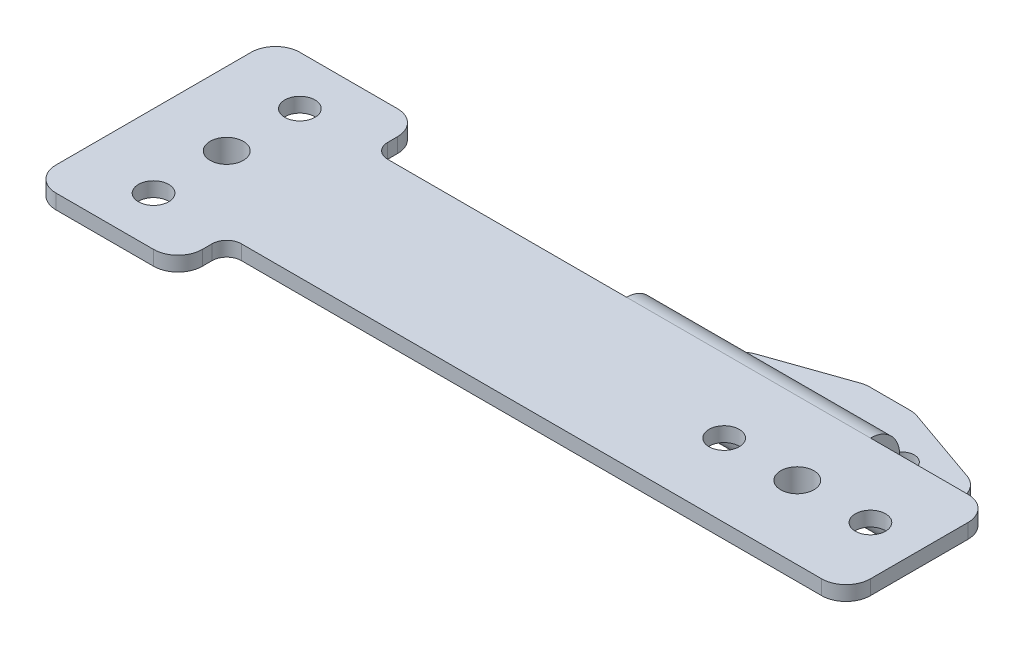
ISO-10303-21;
HEADER;
FILE_DESCRIPTION(('STEP AP214'),'2;1');
FILE_NAME('part.step','',(''),(''),'','','');
FILE_SCHEMA(('AUTOMOTIVE_DESIGN { 1 0 10303 214 1 1 1 1 }'));
ENDSEC;
DATA;
#1=APPLICATION_CONTEXT('core data for automotive mechanical design processes');
#2=APPLICATION_PROTOCOL_DEFINITION('international standard','automotive_design',2000,#1);
#3=PRODUCT_CONTEXT('',#1,'mechanical');
#4=PRODUCT('Part','Part','',(#3));
#5=PRODUCT_RELATED_PRODUCT_CATEGORY('part','',(#4));
#6=PRODUCT_DEFINITION_FORMATION('','',#4);
#7=PRODUCT_DEFINITION_CONTEXT('part definition',#1,'design');
#8=PRODUCT_DEFINITION('design','',#6,#7);
#9=PRODUCT_DEFINITION_SHAPE('','',#8);
#10=(LENGTH_UNIT() NAMED_UNIT(*) SI_UNIT(.MILLI.,.METRE.));
#11=(NAMED_UNIT(*) PLANE_ANGLE_UNIT() SI_UNIT($,.RADIAN.));
#12=(NAMED_UNIT(*) SI_UNIT($,.STERADIAN.) SOLID_ANGLE_UNIT());
#13=UNCERTAINTY_MEASURE_WITH_UNIT(LENGTH_MEASURE(1.E-05),#10,'distance_accuracy_value','');
#14=(GEOMETRIC_REPRESENTATION_CONTEXT(3) GLOBAL_UNCERTAINTY_ASSIGNED_CONTEXT((#13)) GLOBAL_UNIT_ASSIGNED_CONTEXT((#10,
#11,#12)) REPRESENTATION_CONTEXT('',''));
#15=CARTESIAN_POINT('',(0.,0.,0.));
#16=DIRECTION('',(0.,0.,1.));
#17=DIRECTION('',(1.,0.,0.));
#18=AXIS2_PLACEMENT_3D('',#15,#16,#17);
#19=CARTESIAN_POINT('',(-4.15027135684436,121.,270.));
#20=DIRECTION('',(0.,-1.,0.));
#21=DIRECTION('',(0.,0.,-1.));
#22=AXIS2_PLACEMENT_3D('',#19,#20,#21);
#23=CYLINDRICAL_SURFACE('',#22,5.);
#24=CARTESIAN_POINT('',(-4.15027135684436,121.,270.));
#25=DIRECTION('',(0.,-1.,0.));
#26=DIRECTION('',(0.,0.,-1.));
#27=AXIS2_PLACEMENT_3D('',#24,#25,#26);
#28=CIRCLE('',#27,5.);
#29=CARTESIAN_POINT('',(-5.80202348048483,121.,265.28070821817));
#30=VERTEX_POINT('',#29);
#31=CARTESIAN_POINT('',(-4.15027135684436,121.,265.));
#32=VERTEX_POINT('',#31);
#33=EDGE_CURVE('E20',#30,#32,#28,.T.);
#34=ORIENTED_EDGE('',*,*,#33,.T.);
#35=DIRECTION('',(0.,1.,0.));
#36=VECTOR('',#35,1.);
#37=CARTESIAN_POINT('',(-4.15027135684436,121.,265.));
#38=LINE('',#37,#36);
#39=CARTESIAN_POINT('',(-4.15027135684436,118.,265.));
#40=VERTEX_POINT('',#39);
#41=EDGE_CURVE('E279',#40,#32,#38,.T.);
#42=ORIENTED_EDGE('',*,*,#41,.F.);
#43=CARTESIAN_POINT('',(-4.15027135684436,118.,270.));
#44=DIRECTION('',(0.,-1.,0.));
#45=DIRECTION('',(0.,0.,-1.));
#46=AXIS2_PLACEMENT_3D('',#43,#44,#45);
#47=CIRCLE('',#46,5.);
#48=CARTESIAN_POINT('',(-5.80202348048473,118.,265.28070821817));
#49=VERTEX_POINT('',#48);
#50=EDGE_CURVE('E239',#49,#40,#47,.T.);
#51=ORIENTED_EDGE('',*,*,#50,.F.);
#52=DIRECTION('',(0.,1.,0.));
#53=VECTOR('',#52,1.);
#54=CARTESIAN_POINT('',(-5.80202348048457,121.,265.28070821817));
#55=LINE('',#54,#53);
#56=EDGE_CURVE('E238',#49,#30,#55,.T.);
#57=ORIENTED_EDGE('',*,*,#56,.T.);
#58=EDGE_LOOP('',(#34,#42,#51,#57));
#59=FACE_BOUND('',#58,.T.);
#60=ADVANCED_FACE('F17',(#59),#23,.T.);
#61=CARTESIAN_POINT('',(4.15027135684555,121.,270.));
#62=DIRECTION('',(0.,1.,0.));
#63=DIRECTION('',(0.,0.,1.));
#64=AXIS2_PLACEMENT_3D('',#61,#62,#63);
#65=CYLINDRICAL_SURFACE('',#64,5.);
#66=CARTESIAN_POINT('',(4.15027135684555,118.,270.));
#67=DIRECTION('',(0.,1.,0.));
#68=DIRECTION('',(0.,0.,1.));
#69=AXIS2_PLACEMENT_3D('',#66,#67,#68);
#70=CIRCLE('',#69,5.);
#71=CARTESIAN_POINT('',(4.15027135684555,118.,265.));
#72=VERTEX_POINT('',#71);
#73=CARTESIAN_POINT('',(5.80202348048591,118.,265.28070821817));
#74=VERTEX_POINT('',#73);
#75=EDGE_CURVE('E454',#72,#74,#70,.F.);
#76=ORIENTED_EDGE('',*,*,#75,.F.);
#77=DIRECTION('',(0.,1.,0.));
#78=VECTOR('',#77,1.);
#79=CARTESIAN_POINT('',(4.15027135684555,121.,265.));
#80=LINE('',#79,#78);
#81=CARTESIAN_POINT('',(4.15027135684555,121.,265.));
#82=VERTEX_POINT('',#81);
#83=EDGE_CURVE('E276',#82,#72,#80,.F.);
#84=ORIENTED_EDGE('',*,*,#83,.F.);
#85=CARTESIAN_POINT('',(4.15027135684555,121.,270.));
#86=DIRECTION('',(0.,1.,0.));
#87=DIRECTION('',(0.,0.,1.));
#88=AXIS2_PLACEMENT_3D('',#85,#86,#87);
#89=CIRCLE('',#88,5.);
#90=CARTESIAN_POINT('',(5.80202348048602,121.,265.280708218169));
#91=VERTEX_POINT('',#90);
#92=EDGE_CURVE('E236',#82,#91,#89,.F.);
#93=ORIENTED_EDGE('',*,*,#92,.T.);
#94=DIRECTION('',(0.,1.,0.));
#95=VECTOR('',#94,1.);
#96=CARTESIAN_POINT('',(5.80202348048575,121.,265.28070821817));
#97=LINE('',#96,#95);
#98=EDGE_CURVE('E284',#91,#74,#97,.F.);
#99=ORIENTED_EDGE('',*,*,#98,.T.);
#100=EDGE_LOOP('',(#76,#84,#93,#99));
#101=FACE_BOUND('',#100,.T.);
#102=ADVANCED_FACE('F460',(#101),#65,.T.);
#103=CARTESIAN_POINT('',(5.96744875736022E-13,118.,275.));
#104=DIRECTION('',(0.,-1.,0.));
#105=DIRECTION('',(0.,0.,-1.));
#106=AXIS2_PLACEMENT_3D('',#103,#104,#105);
#107=PLANE('',#106);
#108=DIRECTION('',(0.,0.,-1.));
#109=VECTOR('',#108,1.);
#110=CARTESIAN_POINT('',(25.0000000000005,118.,275.));
#111=LINE('',#110,#109);
#112=CARTESIAN_POINT('',(25.0000000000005,118.,285.));
#113=VERTEX_POINT('',#112);
#114=CARTESIAN_POINT('',(25.0000000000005,118.,275.547405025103));
#115=VERTEX_POINT('',#114);
#116=EDGE_CURVE('E272',#113,#115,#111,.T.);
#117=ORIENTED_EDGE('',*,*,#116,.F.);
#118=DIRECTION('',(-1.,0.,0.));
#119=VECTOR('',#118,1.);
#120=CARTESIAN_POINT('',(-24.9999999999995,118.,285.));
#121=LINE('',#120,#119);
#122=CARTESIAN_POINT('',(-24.9999999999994,118.,285.));
#123=VERTEX_POINT('',#122);
#124=EDGE_CURVE('E265',#123,#113,#121,.F.);
#125=ORIENTED_EDGE('',*,*,#124,.F.);
#126=DIRECTION('',(0.,0.,1.));
#127=VECTOR('',#126,1.);
#128=CARTESIAN_POINT('',(-24.9999999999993,118.,275.));
#129=LINE('',#128,#127);
#130=CARTESIAN_POINT('',(-24.9999999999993,118.,275.547405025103));
#131=VERTEX_POINT('',#130);
#132=EDGE_CURVE('E268',#131,#123,#129,.T.);
#133=ORIENTED_EDGE('',*,*,#132,.F.);
#134=CARTESIAN_POINT('',(-19.9999999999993,118.,275.547405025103));
#135=DIRECTION('',(0.,1.,0.));
#136=DIRECTION('',(0.,0.,1.));
#137=AXIS2_PLACEMENT_3D('',#134,#135,#136);
#138=CIRCLE('',#137,5.);
#139=CARTESIAN_POINT('',(-21.6517521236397,118.,270.828113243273));
#140=VERTEX_POINT('',#139);
#141=EDGE_CURVE('E291',#140,#131,#138,.T.);
#142=ORIENTED_EDGE('',*,*,#141,.F.);
#143=DIRECTION('',(0.943858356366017,0.,-0.330350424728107));
#144=VECTOR('',#143,1.);
#145=CARTESIAN_POINT('',(-24.9999999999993,118.,272.));
#146=LINE('',#145,#144);
#147=EDGE_CURVE('E242',#140,#49,#146,.T.);
#148=ORIENTED_EDGE('',*,*,#147,.T.);
#149=ORIENTED_EDGE('',*,*,#50,.T.);
#150=DIRECTION('',(1.,0.,0.));
#151=VECTOR('',#150,1.);
#152=CARTESIAN_POINT('',(5.96744875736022E-13,118.,265.));
#153=LINE('',#152,#151);
#154=EDGE_CURVE('E281',#72,#40,#153,.F.);
#155=ORIENTED_EDGE('',*,*,#154,.F.);
#156=ORIENTED_EDGE('',*,*,#75,.T.);
#157=DIRECTION('',(0.943858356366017,0.,0.330350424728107));
#158=VECTOR('',#157,1.);
#159=CARTESIAN_POINT('',(5.0000000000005,118.,265.));
#160=LINE('',#159,#158);
#161=CARTESIAN_POINT('',(21.6517521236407,118.,270.828113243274));
#162=VERTEX_POINT('',#161);
#163=EDGE_CURVE('E287',#74,#162,#160,.T.);
#164=ORIENTED_EDGE('',*,*,#163,.T.);
#165=CARTESIAN_POINT('',(20.0000000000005,118.,275.547405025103));
#166=DIRECTION('',(0.,-1.,0.));
#167=DIRECTION('',(0.,0.,-1.));
#168=AXIS2_PLACEMENT_3D('',#165,#166,#167);
#169=CIRCLE('',#168,5.);
#170=EDGE_CURVE('E285',#115,#162,#169,.F.);
#171=ORIENTED_EDGE('',*,*,#170,.F.);
#172=EDGE_LOOP('',(#117,#125,#133,#142,#148,#149,#155,#156,#164,#171));
#173=FACE_BOUND('',#172,.T.);
#174=CARTESIAN_POINT('',(-12.4999999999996,118.,275.));
#175=DIRECTION('',(0.,-1.,0.));
#176=DIRECTION('',(0.,0.,-1.));
#177=AXIS2_PLACEMENT_3D('',#174,#175,#176);
#178=CIRCLE('',#177,2.5);
#179=CARTESIAN_POINT('',(-12.4999999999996,118.,272.5));
#180=VERTEX_POINT('',#179);
#181=EDGE_CURVE('E243',#180,#180,#178,.F.);
#182=ORIENTED_EDGE('',*,*,#181,.T.);
#183=EDGE_LOOP('',(#182));
#184=FACE_BOUND('',#183,.T.);
#185=CARTESIAN_POINT('',(12.5000000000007,118.,275.));
#186=DIRECTION('',(0.,-1.,0.));
#187=DIRECTION('',(0.,0.,-1.));
#188=AXIS2_PLACEMENT_3D('',#185,#186,#187);
#189=CIRCLE('',#188,2.5);
#190=CARTESIAN_POINT('',(12.5000000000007,118.,272.5));
#191=VERTEX_POINT('',#190);
#192=EDGE_CURVE('E451',#191,#191,#189,.F.);
#193=ORIENTED_EDGE('',*,*,#192,.T.);
#194=EDGE_LOOP('',(#193));
#195=FACE_BOUND('',#194,.T.);
#196=ADVANCED_FACE('F491',(#173,#184,#195),#107,.T.);
#197=CARTESIAN_POINT('',(12.5000000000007,121.,275.));
#198=DIRECTION('',(0.,-1.,0.));
#199=DIRECTION('',(0.,0.,-1.));
#200=AXIS2_PLACEMENT_3D('',#197,#198,#199);
#201=CYLINDRICAL_SURFACE('',#200,2.5);
#202=CARTESIAN_POINT('',(12.5000000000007,121.,275.));
#203=DIRECTION('',(0.,-1.,0.));
#204=DIRECTION('',(0.,0.,-1.));
#205=AXIS2_PLACEMENT_3D('',#202,#203,#204);
#206=CIRCLE('',#205,2.5);
#207=CARTESIAN_POINT('',(12.5000000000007,121.,272.5));
#208=VERTEX_POINT('',#207);
#209=EDGE_CURVE('E255',#208,#208,#206,.T.);
#210=ORIENTED_EDGE('',*,*,#209,.F.);
#211=EDGE_LOOP('',(#210));
#212=FACE_BOUND('',#211,.T.);
#213=ORIENTED_EDGE('',*,*,#192,.F.);
#214=EDGE_LOOP('',(#213));
#215=FACE_BOUND('',#214,.T.);
#216=ADVANCED_FACE('F923',(#212,#215),#201,.F.);
#217=CARTESIAN_POINT('',(-12.4999999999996,121.,275.));
#218=DIRECTION('',(0.,-1.,0.));
#219=DIRECTION('',(0.,0.,-1.));
#220=AXIS2_PLACEMENT_3D('',#217,#218,#219);
#221=CYLINDRICAL_SURFACE('',#220,2.5);
#222=CARTESIAN_POINT('',(-12.4999999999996,121.,275.));
#223=DIRECTION('',(0.,-1.,0.));
#224=DIRECTION('',(0.,0.,-1.));
#225=AXIS2_PLACEMENT_3D('',#222,#223,#224);
#226=CIRCLE('',#225,2.5);
#227=CARTESIAN_POINT('',(-12.4999999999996,121.,272.5));
#228=VERTEX_POINT('',#227);
#229=EDGE_CURVE('E250',#228,#228,#226,.T.);
#230=ORIENTED_EDGE('',*,*,#229,.F.);
#231=EDGE_LOOP('',(#230));
#232=FACE_BOUND('',#231,.T.);
#233=ORIENTED_EDGE('',*,*,#181,.F.);
#234=EDGE_LOOP('',(#233));
#235=FACE_BOUND('',#234,.T.);
#236=ADVANCED_FACE('F915',(#232,#235),#221,.F.);
#237=CARTESIAN_POINT('',(-24.9999999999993,121.,272.));
#238=DIRECTION('',(0.330350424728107,0.,0.943858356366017));
#239=DIRECTION('',(0.943858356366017,0.,-0.330350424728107));
#240=AXIS2_PLACEMENT_3D('',#237,#238,#239);
#241=PLANE('',#240);
#242=DIRECTION('',(0.,1.,0.));
#243=VECTOR('',#242,1.);
#244=CARTESIAN_POINT('',(-21.6517521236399,121.,270.828113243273));
#245=LINE('',#244,#243);
#246=CARTESIAN_POINT('',(-21.6517521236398,121.,270.828113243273));
#247=VERTEX_POINT('',#246);
#248=EDGE_CURVE('E247',#247,#140,#245,.F.);
#249=ORIENTED_EDGE('',*,*,#248,.F.);
#250=DIRECTION('',(-0.943858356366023,0.,0.330350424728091));
#251=VECTOR('',#250,1.);
#252=CARTESIAN_POINT('',(-5.80202348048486,121.,265.280708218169));
#253=LINE('',#252,#251);
#254=EDGE_CURVE('E230',#30,#247,#253,.T.);
#255=ORIENTED_EDGE('',*,*,#254,.F.);
#256=ORIENTED_EDGE('',*,*,#56,.F.);
#257=ORIENTED_EDGE('',*,*,#147,.F.);
#258=EDGE_LOOP('',(#249,#255,#256,#257));
#259=FACE_BOUND('',#258,.T.);
#260=ADVANCED_FACE('F245',(#259),#241,.F.);
#261=CARTESIAN_POINT('',(-19.9999999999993,121.,275.547405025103));
#262=DIRECTION('',(0.,1.,0.));
#263=DIRECTION('',(0.,0.,1.));
#264=AXIS2_PLACEMENT_3D('',#261,#262,#263);
#265=CYLINDRICAL_SURFACE('',#264,5.);
#266=ORIENTED_EDGE('',*,*,#141,.T.);
#267=DIRECTION('',(0.,1.,0.));
#268=VECTOR('',#267,1.);
#269=CARTESIAN_POINT('',(-24.9999999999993,121.,275.547405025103));
#270=LINE('',#269,#268);
#271=CARTESIAN_POINT('',(-24.9999999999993,121.,275.547405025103));
#272=VERTEX_POINT('',#271);
#273=EDGE_CURVE('E271',#272,#131,#270,.F.);
#274=ORIENTED_EDGE('',*,*,#273,.F.);
#275=CARTESIAN_POINT('',(-19.9999999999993,121.,275.547405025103));
#276=DIRECTION('',(0.,1.,0.));
#277=DIRECTION('',(0.,0.,1.));
#278=AXIS2_PLACEMENT_3D('',#275,#276,#277);
#279=CIRCLE('',#278,5.);
#280=EDGE_CURVE('E249',#247,#272,#279,.T.);
#281=ORIENTED_EDGE('',*,*,#280,.F.);
#282=ORIENTED_EDGE('',*,*,#248,.T.);
#283=EDGE_LOOP('',(#266,#274,#281,#282));
#284=FACE_BOUND('',#283,.T.);
#285=ADVANCED_FACE('F899',(#284),#265,.T.);
#286=CARTESIAN_POINT('',(20.0000000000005,121.,275.547405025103));
#287=DIRECTION('',(0.,-1.,0.));
#288=DIRECTION('',(0.,0.,-1.));
#289=AXIS2_PLACEMENT_3D('',#286,#287,#288);
#290=CYLINDRICAL_SURFACE('',#289,5.);
#291=CARTESIAN_POINT('',(20.0000000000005,121.,275.547405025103));
#292=DIRECTION('',(0.,-1.,0.));
#293=DIRECTION('',(0.,0.,-1.));
#294=AXIS2_PLACEMENT_3D('',#291,#292,#293);
#295=CIRCLE('',#294,5.);
#296=CARTESIAN_POINT('',(25.0000000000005,121.,275.547405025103));
#297=VERTEX_POINT('',#296);
#298=CARTESIAN_POINT('',(21.6517521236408,121.,270.828113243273));
#299=VERTEX_POINT('',#298);
#300=EDGE_CURVE('E440',#297,#299,#295,.F.);
#301=ORIENTED_EDGE('',*,*,#300,.F.);
#302=DIRECTION('',(0.,1.,0.));
#303=VECTOR('',#302,1.);
#304=CARTESIAN_POINT('',(25.0000000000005,121.,275.547405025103));
#305=LINE('',#304,#303);
#306=EDGE_CURVE('E275',#115,#297,#305,.T.);
#307=ORIENTED_EDGE('',*,*,#306,.F.);
#308=ORIENTED_EDGE('',*,*,#170,.T.);
#309=DIRECTION('',(0.,1.,0.));
#310=VECTOR('',#309,1.);
#311=CARTESIAN_POINT('',(21.6517521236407,121.,270.828113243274));
#312=LINE('',#311,#310);
#313=EDGE_CURVE('E282',#162,#299,#312,.T.);
#314=ORIENTED_EDGE('',*,*,#313,.T.);
#315=EDGE_LOOP('',(#301,#307,#308,#314));
#316=FACE_BOUND('',#315,.T.);
#317=ADVANCED_FACE('F489',(#316),#290,.T.);
#318=CARTESIAN_POINT('',(5.0000000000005,121.,265.));
#319=DIRECTION('',(-0.330350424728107,0.,0.943858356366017));
#320=DIRECTION('',(0.943858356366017,0.,0.330350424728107));
#321=AXIS2_PLACEMENT_3D('',#318,#319,#320);
#322=PLANE('',#321);
#323=ORIENTED_EDGE('',*,*,#98,.F.);
#324=DIRECTION('',(-0.943858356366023,0.,-0.330350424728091));
#325=VECTOR('',#324,1.);
#326=CARTESIAN_POINT('',(21.6517521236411,121.,270.828113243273));
#327=LINE('',#326,#325);
#328=EDGE_CURVE('E442',#299,#91,#327,.T.);
#329=ORIENTED_EDGE('',*,*,#328,.F.);
#330=ORIENTED_EDGE('',*,*,#313,.F.);
#331=ORIENTED_EDGE('',*,*,#163,.F.);
#332=EDGE_LOOP('',(#323,#329,#330,#331));
#333=FACE_BOUND('',#332,.T.);
#334=ADVANCED_FACE('F465',(#333),#322,.F.);
#335=CARTESIAN_POINT('',(5.96744875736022E-13,121.,265.));
#336=DIRECTION('',(0.,0.,-1.));
#337=DIRECTION('',(0.,1.,0.));
#338=AXIS2_PLACEMENT_3D('',#335,#336,#337);
#339=PLANE('',#338);
#340=DIRECTION('',(1.,0.,0.));
#341=VECTOR('',#340,1.);
#342=CARTESIAN_POINT('',(5.96744875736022E-13,121.,265.));
#343=LINE('',#342,#341);
#344=EDGE_CURVE('E232',#82,#32,#343,.F.);
#345=ORIENTED_EDGE('',*,*,#344,.F.);
#346=ORIENTED_EDGE('',*,*,#83,.T.);
#347=ORIENTED_EDGE('',*,*,#154,.T.);
#348=ORIENTED_EDGE('',*,*,#41,.T.);
#349=EDGE_LOOP('',(#345,#346,#347,#348));
#350=FACE_BOUND('',#349,.T.);
#351=ADVANCED_FACE('F495',(#350),#339,.T.);
#352=CARTESIAN_POINT('',(-24.9999999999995,124.,285.));
#353=DIRECTION('',(-1.,0.,0.));
#354=DIRECTION('',(0.,0.,1.));
#355=AXIS2_PLACEMENT_3D('',#352,#353,#354);
#356=CYLINDRICAL_SURFACE('',#355,6.);
#357=DIRECTION('',(1.,0.,0.));
#358=VECTOR('',#357,1.);
#359=CARTESIAN_POINT('',(25.0000000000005,124.,291.));
#360=LINE('',#359,#358);
#361=CARTESIAN_POINT('',(-24.9999999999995,124.,291.));
#362=VERTEX_POINT('',#361);
#363=CARTESIAN_POINT('',(25.0000000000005,124.,291.));
#364=VERTEX_POINT('',#363);
#365=EDGE_CURVE('E433',#362,#364,#360,.T.);
#366=ORIENTED_EDGE('',*,*,#365,.F.);
#367=CARTESIAN_POINT('',(-24.9999999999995,124.,285.));
#368=DIRECTION('',(-1.,0.,0.));
#369=DIRECTION('',(0.,0.,1.));
#370=AXIS2_PLACEMENT_3D('',#367,#368,#369);
#371=CIRCLE('',#370,6.);
#372=EDGE_CURVE('E434',#123,#362,#371,.T.);
#373=ORIENTED_EDGE('',*,*,#372,.F.);
#374=ORIENTED_EDGE('',*,*,#124,.T.);
#375=CARTESIAN_POINT('',(25.0000000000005,124.,285.));
#376=DIRECTION('',(-1.,0.,0.));
#377=DIRECTION('',(0.,0.,1.));
#378=AXIS2_PLACEMENT_3D('',#375,#376,#377);
#379=CIRCLE('',#378,6.);
#380=EDGE_CURVE('E437',#364,#113,#379,.F.);
#381=ORIENTED_EDGE('',*,*,#380,.F.);
#382=EDGE_LOOP('',(#366,#373,#374,#381));
#383=FACE_BOUND('',#382,.T.);
#384=ADVANCED_FACE('F497',(#383),#356,.T.);
#385=CARTESIAN_POINT('',(5.96744875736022E-13,121.,275.));
#386=DIRECTION('',(0.,1.,0.));
#387=DIRECTION('',(0.,0.,1.));
#388=AXIS2_PLACEMENT_3D('',#385,#386,#387);
#389=PLANE('',#388);
#390=ORIENTED_EDGE('',*,*,#344,.T.);
#391=ORIENTED_EDGE('',*,*,#33,.F.);
#392=ORIENTED_EDGE('',*,*,#254,.T.);
#393=ORIENTED_EDGE('',*,*,#280,.T.);
#394=DIRECTION('',(0.,0.,1.));
#395=VECTOR('',#394,1.);
#396=CARTESIAN_POINT('',(-24.9999999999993,121.,275.));
#397=LINE('',#396,#395);
#398=CARTESIAN_POINT('',(-24.9999999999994,121.,285.));
#399=VERTEX_POINT('',#398);
#400=EDGE_CURVE('E252',#272,#399,#397,.T.);
#401=ORIENTED_EDGE('',*,*,#400,.T.);
#402=DIRECTION('',(-1.,0.,0.));
#403=VECTOR('',#402,1.);
#404=CARTESIAN_POINT('',(-24.9999999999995,121.,285.));
#405=LINE('',#404,#403);
#406=CARTESIAN_POINT('',(25.0000000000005,121.,285.));
#407=VERTEX_POINT('',#406);
#408=EDGE_CURVE('E260',#399,#407,#405,.F.);
#409=ORIENTED_EDGE('',*,*,#408,.T.);
#410=DIRECTION('',(0.,0.,1.));
#411=VECTOR('',#410,1.);
#412=CARTESIAN_POINT('',(25.0000000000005,121.,275.));
#413=LINE('',#412,#411);
#414=EDGE_CURVE('E443',#407,#297,#413,.F.);
#415=ORIENTED_EDGE('',*,*,#414,.T.);
#416=ORIENTED_EDGE('',*,*,#300,.T.);
#417=ORIENTED_EDGE('',*,*,#328,.T.);
#418=ORIENTED_EDGE('',*,*,#92,.F.);
#419=EDGE_LOOP('',(#390,#391,#392,#393,#401,#409,#415,#416,#417,#418));
#420=FACE_BOUND('',#419,.T.);
#421=ORIENTED_EDGE('',*,*,#229,.T.);
#422=EDGE_LOOP('',(#421));
#423=FACE_BOUND('',#422,.T.);
#424=ORIENTED_EDGE('',*,*,#209,.T.);
#425=EDGE_LOOP('',(#424));
#426=FACE_BOUND('',#425,.T.);
#427=ADVANCED_FACE('F226',(#420,#423,#426),#389,.T.);
#428=CARTESIAN_POINT('',(25.0000000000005,124.,291.));
#429=DIRECTION('',(0.,0.,1.));
#430=DIRECTION('',(1.,0.,0.));
#431=AXIS2_PLACEMENT_3D('',#428,#429,#430);
#432=PLANE('',#431);
#433=DIRECTION('',(1.,0.,0.));
#434=VECTOR('',#433,1.);
#435=CARTESIAN_POINT('',(25.0000000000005,135.,291.));
#436=LINE('',#435,#434);
#437=CARTESIAN_POINT('',(25.0000000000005,135.,291.));
#438=VERTEX_POINT('',#437);
#439=CARTESIAN_POINT('',(-24.9999999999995,135.,291.));
#440=VERTEX_POINT('',#439);
#441=EDGE_CURVE('E429',#438,#440,#436,.F.);
#442=ORIENTED_EDGE('',*,*,#441,.T.);
#443=DIRECTION('',(0.,1.,0.));
#444=VECTOR('',#443,1.);
#445=CARTESIAN_POINT('',(-24.9999999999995,124.,291.));
#446=LINE('',#445,#444);
#447=EDGE_CURVE('E1027',#362,#440,#446,.T.);
#448=ORIENTED_EDGE('',*,*,#447,.F.);
#449=ORIENTED_EDGE('',*,*,#365,.T.);
#450=DIRECTION('',(0.,1.,0.));
#451=VECTOR('',#450,1.);
#452=CARTESIAN_POINT('',(25.0000000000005,124.,291.));
#453=LINE('',#452,#451);
#454=EDGE_CURVE('E263',#438,#364,#453,.F.);
#455=ORIENTED_EDGE('',*,*,#454,.F.);
#456=EDGE_LOOP('',(#442,#448,#449,#455));
#457=FACE_BOUND('',#456,.T.);
#458=ADVANCED_FACE('F646',(#457),#432,.T.);
#459=CARTESIAN_POINT('',(-24.9999999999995,124.,285.));
#460=DIRECTION('',(-1.,0.,0.));
#461=DIRECTION('',(0.,0.,1.));
#462=AXIS2_PLACEMENT_3D('',#459,#460,#461);
#463=CYLINDRICAL_SURFACE('',#462,3.);
#464=CARTESIAN_POINT('',(-24.9999999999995,124.,285.));
#465=DIRECTION('',(-1.,0.,0.));
#466=DIRECTION('',(0.,0.,1.));
#467=AXIS2_PLACEMENT_3D('',#464,#465,#466);
#468=CIRCLE('',#467,3.);
#469=CARTESIAN_POINT('',(-24.9999999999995,124.,288.));
#470=VERTEX_POINT('',#469);
#471=EDGE_CURVE('E264',#470,#399,#468,.F.);
#472=ORIENTED_EDGE('',*,*,#471,.F.);
#473=DIRECTION('',(-1.,0.,0.));
#474=VECTOR('',#473,1.);
#475=CARTESIAN_POINT('',(-24.9999999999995,124.,288.));
#476=LINE('',#475,#474);
#477=CARTESIAN_POINT('',(25.0000000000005,124.,288.));
#478=VERTEX_POINT('',#477);
#479=EDGE_CURVE('E425',#478,#470,#476,.T.);
#480=ORIENTED_EDGE('',*,*,#479,.F.);
#481=CARTESIAN_POINT('',(25.0000000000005,124.,285.));
#482=DIRECTION('',(-1.,0.,0.));
#483=DIRECTION('',(0.,0.,1.));
#484=AXIS2_PLACEMENT_3D('',#481,#482,#483);
#485=CIRCLE('',#484,3.);
#486=EDGE_CURVE('E431',#407,#478,#485,.T.);
#487=ORIENTED_EDGE('',*,*,#486,.F.);
#488=ORIENTED_EDGE('',*,*,#408,.F.);
#489=EDGE_LOOP('',(#472,#480,#487,#488));
#490=FACE_BOUND('',#489,.T.);
#491=ADVANCED_FACE('F478',(#490),#463,.F.);
#492=CARTESIAN_POINT('',(-92.,138.,309.));
#493=DIRECTION('',(0.,-1.,0.));
#494=DIRECTION('',(0.,0.,-1.));
#495=AXIS2_PLACEMENT_3D('',#492,#493,#494);
#496=CYLINDRICAL_SURFACE('',#495,6.);
#497=CARTESIAN_POINT('',(-92.,138.,309.));
#498=DIRECTION('',(0.,-1.,0.));
#499=DIRECTION('',(0.,0.,-1.));
#500=AXIS2_PLACEMENT_3D('',#497,#498,#499);
#501=CIRCLE('',#500,6.);
#502=CARTESIAN_POINT('',(-92.,138.,303.));
#503=VERTEX_POINT('',#502);
#504=EDGE_CURVE('E412',#503,#503,#501,.F.);
#505=ORIENTED_EDGE('',*,*,#504,.F.);
#506=EDGE_LOOP('',(#505));
#507=FACE_BOUND('',#506,.T.);
#508=CARTESIAN_POINT('',(-92.,134.,309.));
#509=DIRECTION('',(0.,-1.,0.));
#510=DIRECTION('',(0.,0.,-1.));
#511=AXIS2_PLACEMENT_3D('',#508,#509,#510);
#512=CIRCLE('',#511,6.);
#513=CARTESIAN_POINT('',(-92.,134.,303.));
#514=VERTEX_POINT('',#513);
#515=EDGE_CURVE('E426',#514,#514,#512,.T.);
#516=ORIENTED_EDGE('',*,*,#515,.F.);
#517=EDGE_LOOP('',(#516));
#518=FACE_BOUND('',#517,.T.);
#519=ADVANCED_FACE('F639',(#507,#518),#496,.T.);
#520=CARTESIAN_POINT('',(25.0000000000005,138.,309.));
#521=DIRECTION('',(0.,-1.,0.));
#522=DIRECTION('',(0.,0.,-1.));
#523=AXIS2_PLACEMENT_3D('',#520,#521,#522);
#524=CYLINDRICAL_SURFACE('',#523,6.);
#525=CARTESIAN_POINT('',(25.0000000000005,138.,309.));
#526=DIRECTION('',(0.,-1.,0.));
#527=DIRECTION('',(0.,0.,-1.));
#528=AXIS2_PLACEMENT_3D('',#525,#526,#527);
#529=CIRCLE('',#528,6.);
#530=CARTESIAN_POINT('',(25.0000000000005,138.,303.));
#531=VERTEX_POINT('',#530);
#532=EDGE_CURVE('E409',#531,#531,#529,.F.);
#533=ORIENTED_EDGE('',*,*,#532,.F.);
#534=EDGE_LOOP('',(#533));
#535=FACE_BOUND('',#534,.T.);
#536=CARTESIAN_POINT('',(25.0000000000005,134.,309.));
#537=DIRECTION('',(0.,-1.,0.));
#538=DIRECTION('',(0.,0.,-1.));
#539=AXIS2_PLACEMENT_3D('',#536,#537,#538);
#540=CIRCLE('',#539,6.);
#541=CARTESIAN_POINT('',(25.0000000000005,134.,303.));
#542=VERTEX_POINT('',#541);
#543=EDGE_CURVE('E422',#542,#542,#540,.T.);
#544=ORIENTED_EDGE('',*,*,#543,.F.);
#545=EDGE_LOOP('',(#544));
#546=FACE_BOUND('',#545,.T.);
#547=ADVANCED_FACE('F635',(#535,#546),#524,.T.);
#548=CARTESIAN_POINT('',(25.0000000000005,135.,294.));
#549=DIRECTION('',(1.,0.,0.));
#550=DIRECTION('',(0.,0.,-1.));
#551=AXIS2_PLACEMENT_3D('',#548,#549,#550);
#552=CYLINDRICAL_SURFACE('',#551,3.);
#553=CARTESIAN_POINT('',(25.0000000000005,135.,294.));
#554=DIRECTION('',(1.,0.,0.));
#555=DIRECTION('',(0.,0.,-1.));
#556=AXIS2_PLACEMENT_3D('',#553,#554,#555);
#557=CIRCLE('',#556,3.);
#558=CARTESIAN_POINT('',(25.0000000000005,138.,294.));
#559=VERTEX_POINT('',#558);
#560=EDGE_CURVE('E418',#559,#438,#557,.F.);
#561=ORIENTED_EDGE('',*,*,#560,.F.);
#562=DIRECTION('',(1.,0.,0.));
#563=VECTOR('',#562,1.);
#564=CARTESIAN_POINT('',(25.0000000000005,138.,294.));
#565=LINE('',#564,#563);
#566=CARTESIAN_POINT('',(-24.9999999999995,138.,294.));
#567=VERTEX_POINT('',#566);
#568=EDGE_CURVE('E408',#567,#559,#565,.T.);
#569=ORIENTED_EDGE('',*,*,#568,.F.);
#570=CARTESIAN_POINT('',(-24.9999999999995,135.,294.));
#571=DIRECTION('',(1.,0.,0.));
#572=DIRECTION('',(0.,0.,-1.));
#573=AXIS2_PLACEMENT_3D('',#570,#571,#572);
#574=CIRCLE('',#573,3.);
#575=EDGE_CURVE('E415',#440,#567,#574,.T.);
#576=ORIENTED_EDGE('',*,*,#575,.F.);
#577=ORIENTED_EDGE('',*,*,#441,.F.);
#578=EDGE_LOOP('',(#561,#569,#576,#577));
#579=FACE_BOUND('',#578,.T.);
#580=ADVANCED_FACE('F631',(#579),#552,.F.);
#581=CARTESIAN_POINT('',(-92.,134.,309.));
#582=DIRECTION('',(0.,-1.,0.));
#583=DIRECTION('',(0.,0.,-1.));
#584=AXIS2_PLACEMENT_3D('',#581,#582,#583);
#585=PLANE('',#584);
#586=ORIENTED_EDGE('',*,*,#515,.T.);
#587=EDGE_LOOP('',(#586));
#588=FACE_BOUND('',#587,.T.);
#589=CARTESIAN_POINT('',(-92.,134.,309.));
#590=DIRECTION('',(0.,1.,0.));
#591=DIRECTION('',(0.,0.,1.));
#592=AXIS2_PLACEMENT_3D('',#589,#590,#591);
#593=CIRCLE('',#592,3.4);
#594=CARTESIAN_POINT('',(-92.,134.,312.4));
#595=VERTEX_POINT('',#594);
#596=EDGE_CURVE('E405',#595,#595,#593,.T.);
#597=ORIENTED_EDGE('',*,*,#596,.T.);
#598=EDGE_LOOP('',(#597));
#599=FACE_BOUND('',#598,.T.);
#600=ADVANCED_FACE('F627',(#588,#599),#585,.T.);
#601=CARTESIAN_POINT('',(25.0000000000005,134.,309.));
#602=DIRECTION('',(0.,-1.,0.));
#603=DIRECTION('',(0.,0.,-1.));
#604=AXIS2_PLACEMENT_3D('',#601,#602,#603);
#605=PLANE('',#604);
#606=ORIENTED_EDGE('',*,*,#543,.T.);
#607=EDGE_LOOP('',(#606));
#608=FACE_BOUND('',#607,.T.);
#609=CARTESIAN_POINT('',(25.0000000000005,134.,309.));
#610=DIRECTION('',(0.,1.,0.));
#611=DIRECTION('',(0.,0.,1.));
#612=AXIS2_PLACEMENT_3D('',#609,#610,#611);
#613=CIRCLE('',#612,3.4);
#614=CARTESIAN_POINT('',(25.0000000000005,134.,312.4));
#615=VERTEX_POINT('',#614);
#616=EDGE_CURVE('E396',#615,#615,#613,.T.);
#617=ORIENTED_EDGE('',*,*,#616,.T.);
#618=EDGE_LOOP('',(#617));
#619=FACE_BOUND('',#618,.T.);
#620=ADVANCED_FACE('F623',(#608,#619),#605,.T.);
#621=CARTESIAN_POINT('',(-24.9999999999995,124.,288.));
#622=DIRECTION('',(0.,0.,-1.));
#623=DIRECTION('',(-1.,0.,0.));
#624=AXIS2_PLACEMENT_3D('',#621,#622,#623);
#625=PLANE('',#624);
#626=DIRECTION('',(1.,0.,0.));
#627=VECTOR('',#626,1.);
#628=CARTESIAN_POINT('',(25.0000000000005,135.,288.));
#629=LINE('',#628,#627);
#630=CARTESIAN_POINT('',(25.0000000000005,135.,288.));
#631=VERTEX_POINT('',#630);
#632=CARTESIAN_POINT('',(-24.9999999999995,135.,288.));
#633=VERTEX_POINT('',#632);
#634=EDGE_CURVE('E385',#631,#633,#629,.F.);
#635=ORIENTED_EDGE('',*,*,#634,.F.);
#636=DIRECTION('',(0.,1.,0.));
#637=VECTOR('',#636,1.);
#638=CARTESIAN_POINT('',(25.0000000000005,124.,288.));
#639=LINE('',#638,#637);
#640=EDGE_CURVE('E421',#631,#478,#639,.F.);
#641=ORIENTED_EDGE('',*,*,#640,.T.);
#642=ORIENTED_EDGE('',*,*,#479,.T.);
#643=DIRECTION('',(0.,1.,0.));
#644=VECTOR('',#643,1.);
#645=CARTESIAN_POINT('',(-24.9999999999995,124.,288.));
#646=LINE('',#645,#644);
#647=EDGE_CURVE('E1022',#470,#633,#646,.T.);
#648=ORIENTED_EDGE('',*,*,#647,.T.);
#649=EDGE_LOOP('',(#635,#641,#642,#648));
#650=FACE_BOUND('',#649,.T.);
#651=ADVANCED_FACE('F620',(#650),#625,.T.);
#652=CARTESIAN_POINT('',(25.0000000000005,135.,294.));
#653=DIRECTION('',(1.,0.,0.));
#654=DIRECTION('',(0.,0.,-1.));
#655=AXIS2_PLACEMENT_3D('',#652,#653,#654);
#656=PLANE('',#655);
#657=DIRECTION('',(0.,1.,0.));
#658=VECTOR('',#657,1.);
#659=CARTESIAN_POINT('',(25.0000000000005,138.,294.));
#660=LINE('',#659,#658);
#661=CARTESIAN_POINT('',(25.0000000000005,141.,294.));
#662=VERTEX_POINT('',#661);
#663=EDGE_CURVE('E998',#559,#662,#660,.T.);
#664=ORIENTED_EDGE('',*,*,#663,.F.);
#665=ORIENTED_EDGE('',*,*,#560,.T.);
#666=ORIENTED_EDGE('',*,*,#454,.T.);
#667=ORIENTED_EDGE('',*,*,#380,.T.);
#668=ORIENTED_EDGE('',*,*,#116,.T.);
#669=ORIENTED_EDGE('',*,*,#306,.T.);
#670=ORIENTED_EDGE('',*,*,#414,.F.);
#671=ORIENTED_EDGE('',*,*,#486,.T.);
#672=ORIENTED_EDGE('',*,*,#640,.F.);
#673=CARTESIAN_POINT('',(25.0000000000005,135.,294.));
#674=DIRECTION('',(1.,0.,0.));
#675=DIRECTION('',(0.,0.,-1.));
#676=AXIS2_PLACEMENT_3D('',#673,#674,#675);
#677=CIRCLE('',#676,6.);
#678=EDGE_CURVE('E378',#662,#631,#677,.F.);
#679=ORIENTED_EDGE('',*,*,#678,.F.);
#680=EDGE_LOOP('',(#664,#665,#666,#667,#668,#669,#670,#671,#672,#679));
#681=FACE_BOUND('',#680,.T.);
#682=ADVANCED_FACE('F485',(#681),#656,.T.);
#683=CARTESIAN_POINT('',(-24.9999999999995,135.,294.));
#684=DIRECTION('',(-1.,0.,0.));
#685=DIRECTION('',(0.,0.,1.));
#686=AXIS2_PLACEMENT_3D('',#683,#684,#685);
#687=PLANE('',#686);
#688=DIRECTION('',(0.,1.,0.));
#689=VECTOR('',#688,1.);
#690=CARTESIAN_POINT('',(-24.9999999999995,138.,294.));
#691=LINE('',#690,#689);
#692=CARTESIAN_POINT('',(-24.9999999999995,141.,294.));
#693=VERTEX_POINT('',#692);
#694=EDGE_CURVE('E377',#693,#567,#691,.F.);
#695=ORIENTED_EDGE('',*,*,#694,.F.);
#696=CARTESIAN_POINT('',(-24.9999999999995,135.,294.));
#697=DIRECTION('',(1.,0.,0.));
#698=DIRECTION('',(0.,0.,-1.));
#699=AXIS2_PLACEMENT_3D('',#696,#697,#698);
#700=CIRCLE('',#699,6.);
#701=EDGE_CURVE('E382',#633,#693,#700,.T.);
#702=ORIENTED_EDGE('',*,*,#701,.F.);
#703=ORIENTED_EDGE('',*,*,#647,.F.);
#704=ORIENTED_EDGE('',*,*,#471,.T.);
#705=ORIENTED_EDGE('',*,*,#400,.F.);
#706=ORIENTED_EDGE('',*,*,#273,.T.);
#707=ORIENTED_EDGE('',*,*,#132,.T.);
#708=ORIENTED_EDGE('',*,*,#372,.T.);
#709=ORIENTED_EDGE('',*,*,#447,.T.);
#710=ORIENTED_EDGE('',*,*,#575,.T.);
#711=EDGE_LOOP('',(#695,#702,#703,#704,#705,#706,#707,#708,#709,#710));
#712=FACE_BOUND('',#711,.T.);
#713=ADVANCED_FACE('F614',(#712),#687,.T.);
#714=CARTESIAN_POINT('',(25.0000000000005,138.,294.));
#715=DIRECTION('',(0.,-1.,0.));
#716=DIRECTION('',(0.,0.,-1.));
#717=AXIS2_PLACEMENT_3D('',#714,#715,#716);
#718=PLANE('',#717);
#719=DIRECTION('',(1.,0.,0.));
#720=VECTOR('',#719,1.);
#721=CARTESIAN_POINT('',(-24.9999999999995,138.,294.));
#722=LINE('',#721,#720);
#723=CARTESIAN_POINT('',(-74.,138.,294.));
#724=VERTEX_POINT('',#723);
#725=EDGE_CURVE('E381',#567,#724,#722,.F.);
#726=ORIENTED_EDGE('',*,*,#725,.F.);
#727=ORIENTED_EDGE('',*,*,#568,.T.);
#728=DIRECTION('',(1.,0.,0.));
#729=VECTOR('',#728,1.);
#730=CARTESIAN_POINT('',(25.0000000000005,138.,294.));
#731=LINE('',#730,#729);
#732=CARTESIAN_POINT('',(45.,138.,294.));
#733=VERTEX_POINT('',#732);
#734=EDGE_CURVE('E997',#733,#559,#731,.F.);
#735=ORIENTED_EDGE('',*,*,#734,.F.);
#736=CARTESIAN_POINT('',(45.,138.,299.));
#737=DIRECTION('',(0.,-1.,0.));
#738=DIRECTION('',(0.,0.,-1.));
#739=AXIS2_PLACEMENT_3D('',#736,#737,#738);
#740=CIRCLE('',#739,5.);
#741=CARTESIAN_POINT('',(50.,138.,299.));
#742=VERTEX_POINT('',#741);
#743=EDGE_CURVE('E386',#742,#733,#740,.F.);
#744=ORIENTED_EDGE('',*,*,#743,.F.);
#745=DIRECTION('',(0.,0.,1.));
#746=VECTOR('',#745,1.);
#747=CARTESIAN_POINT('',(50.,138.,324.));
#748=LINE('',#747,#746);
#749=CARTESIAN_POINT('',(50.,138.,319.));
#750=VERTEX_POINT('',#749);
#751=EDGE_CURVE('E389',#742,#750,#748,.T.);
#752=ORIENTED_EDGE('',*,*,#751,.T.);
#753=CARTESIAN_POINT('',(45.,138.,319.));
#754=DIRECTION('',(0.,-1.,0.));
#755=DIRECTION('',(0.,0.,-1.));
#756=AXIS2_PLACEMENT_3D('',#753,#754,#755);
#757=CIRCLE('',#756,5.);
#758=CARTESIAN_POINT('',(45.,138.,324.));
#759=VERTEX_POINT('',#758);
#760=EDGE_CURVE('E345',#759,#750,#757,.F.);
#761=ORIENTED_EDGE('',*,*,#760,.F.);
#762=DIRECTION('',(1.,0.,0.));
#763=VECTOR('',#762,1.);
#764=CARTESIAN_POINT('',(-24.9999999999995,138.,324.));
#765=LINE('',#764,#763);
#766=CARTESIAN_POINT('',(-74.,138.,324.));
#767=VERTEX_POINT('',#766);
#768=EDGE_CURVE('E349',#767,#759,#765,.T.);
#769=ORIENTED_EDGE('',*,*,#768,.F.);
#770=CARTESIAN_POINT('',(-74.,138.,327.));
#771=DIRECTION('',(0.,-1.,0.));
#772=DIRECTION('',(0.,0.,-1.));
#773=AXIS2_PLACEMENT_3D('',#770,#771,#772);
#774=CIRCLE('',#773,3.);
#775=CARTESIAN_POINT('',(-77.,138.,327.));
#776=VERTEX_POINT('',#775);
#777=EDGE_CURVE('E350',#767,#776,#774,.F.);
#778=ORIENTED_EDGE('',*,*,#777,.T.);
#779=DIRECTION('',(0.,0.,-1.));
#780=VECTOR('',#779,1.);
#781=CARTESIAN_POINT('',(-77.,138.,324.));
#782=LINE('',#781,#780);
#783=CARTESIAN_POINT('',(-77.,138.,329.));
#784=VERTEX_POINT('',#783);
#785=EDGE_CURVE('E1005',#784,#776,#782,.T.);
#786=ORIENTED_EDGE('',*,*,#785,.F.);
#787=CARTESIAN_POINT('',(-82.,138.,329.));
#788=DIRECTION('',(0.,1.,0.));
#789=DIRECTION('',(0.,0.,1.));
#790=AXIS2_PLACEMENT_3D('',#787,#788,#789);
#791=CIRCLE('',#790,5.);
#792=CARTESIAN_POINT('',(-82.,138.,334.));
#793=VERTEX_POINT('',#792);
#794=EDGE_CURVE('E355',#793,#784,#791,.T.);
#795=ORIENTED_EDGE('',*,*,#794,.F.);
#796=DIRECTION('',(1.,0.,0.));
#797=VECTOR('',#796,1.);
#798=CARTESIAN_POINT('',(-107.,138.,334.));
#799=LINE('',#798,#797);
#800=CARTESIAN_POINT('',(-102.,138.,334.));
#801=VERTEX_POINT('',#800);
#802=EDGE_CURVE('E1008',#801,#793,#799,.T.);
#803=ORIENTED_EDGE('',*,*,#802,.F.);
#804=CARTESIAN_POINT('',(-102.,138.,329.));
#805=DIRECTION('',(0.,-1.,0.));
#806=DIRECTION('',(0.,0.,-1.));
#807=AXIS2_PLACEMENT_3D('',#804,#805,#806);
#808=CIRCLE('',#807,5.);
#809=CARTESIAN_POINT('',(-107.,138.,329.));
#810=VERTEX_POINT('',#809);
#811=EDGE_CURVE('E360',#810,#801,#808,.F.);
#812=ORIENTED_EDGE('',*,*,#811,.F.);
#813=DIRECTION('',(0.,0.,-1.));
#814=VECTOR('',#813,1.);
#815=CARTESIAN_POINT('',(-107.,138.,324.));
#816=LINE('',#815,#814);
#817=CARTESIAN_POINT('',(-107.,138.,289.));
#818=VERTEX_POINT('',#817);
#819=EDGE_CURVE('E368',#810,#818,#816,.T.);
#820=ORIENTED_EDGE('',*,*,#819,.T.);
#821=CARTESIAN_POINT('',(-102.,138.,289.));
#822=DIRECTION('',(0.,1.,0.));
#823=DIRECTION('',(0.,0.,1.));
#824=AXIS2_PLACEMENT_3D('',#821,#822,#823);
#825=CIRCLE('',#824,5.);
#826=CARTESIAN_POINT('',(-102.,138.,284.));
#827=VERTEX_POINT('',#826);
#828=EDGE_CURVE('E365',#827,#818,#825,.T.);
#829=ORIENTED_EDGE('',*,*,#828,.F.);
#830=DIRECTION('',(1.,0.,0.));
#831=VECTOR('',#830,1.);
#832=CARTESIAN_POINT('',(-107.,138.,284.));
#833=LINE('',#832,#831);
#834=CARTESIAN_POINT('',(-82.,138.,284.));
#835=VERTEX_POINT('',#834);
#836=EDGE_CURVE('E1012',#835,#827,#833,.F.);
#837=ORIENTED_EDGE('',*,*,#836,.F.);
#838=CARTESIAN_POINT('',(-82.,138.,289.));
#839=DIRECTION('',(0.,-1.,0.));
#840=DIRECTION('',(0.,0.,-1.));
#841=AXIS2_PLACEMENT_3D('',#838,#839,#840);
#842=CIRCLE('',#841,5.);
#843=CARTESIAN_POINT('',(-77.,138.,289.));
#844=VERTEX_POINT('',#843);
#845=EDGE_CURVE('E370',#844,#835,#842,.F.);
#846=ORIENTED_EDGE('',*,*,#845,.F.);
#847=DIRECTION('',(0.,0.,-1.));
#848=VECTOR('',#847,1.);
#849=CARTESIAN_POINT('',(-77.,138.,294.));
#850=LINE('',#849,#848);
#851=CARTESIAN_POINT('',(-77.,138.,291.));
#852=VERTEX_POINT('',#851);
#853=EDGE_CURVE('E1014',#852,#844,#850,.T.);
#854=ORIENTED_EDGE('',*,*,#853,.F.);
#855=CARTESIAN_POINT('',(-74.,138.,291.));
#856=DIRECTION('',(0.,1.,0.));
#857=DIRECTION('',(0.,0.,1.));
#858=AXIS2_PLACEMENT_3D('',#855,#856,#857);
#859=CIRCLE('',#858,3.);
#860=EDGE_CURVE('E374',#852,#724,#859,.T.);
#861=ORIENTED_EDGE('',*,*,#860,.T.);
#862=EDGE_LOOP('',(#726,#727,#735,#744,#752,#761,#769,#778,#786,#795,#803,#812,#820,#829,#837,
#846,#854,#861));
#863=FACE_BOUND('',#862,.T.);
#864=CARTESIAN_POINT('',(40.0000000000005,138.,309.));
#865=DIRECTION('',(0.,1.,0.));
#866=DIRECTION('',(0.,0.,1.));
#867=AXIS2_PLACEMENT_3D('',#864,#865,#866);
#868=CIRCLE('',#867,3.1);
#869=CARTESIAN_POINT('',(40.0000000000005,138.,312.1));
#870=VERTEX_POINT('',#869);
#871=EDGE_CURVE('E390',#870,#870,#868,.T.);
#872=ORIENTED_EDGE('',*,*,#871,.T.);
#873=EDGE_LOOP('',(#872));
#874=FACE_BOUND('',#873,.T.);
#875=CARTESIAN_POINT('',(10.0000000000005,138.,309.));
#876=DIRECTION('',(0.,1.,0.));
#877=DIRECTION('',(0.,0.,1.));
#878=AXIS2_PLACEMENT_3D('',#875,#876,#877);
#879=CIRCLE('',#878,3.1);
#880=CARTESIAN_POINT('',(10.0000000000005,138.,312.1));
#881=VERTEX_POINT('',#880);
#882=EDGE_CURVE('E393',#881,#881,#879,.T.);
#883=ORIENTED_EDGE('',*,*,#882,.T.);
#884=EDGE_LOOP('',(#883));
#885=FACE_BOUND('',#884,.T.);
#886=ORIENTED_EDGE('',*,*,#532,.T.);
#887=EDGE_LOOP('',(#886));
#888=FACE_BOUND('',#887,.T.);
#889=CARTESIAN_POINT('',(-92.,138.,294.));
#890=DIRECTION('',(0.,1.,0.));
#891=DIRECTION('',(0.,0.,1.));
#892=AXIS2_PLACEMENT_3D('',#889,#890,#891);
#893=CIRCLE('',#892,3.1);
#894=CARTESIAN_POINT('',(-92.,138.,297.1));
#895=VERTEX_POINT('',#894);
#896=EDGE_CURVE('E399',#895,#895,#893,.T.);
#897=ORIENTED_EDGE('',*,*,#896,.T.);
#898=EDGE_LOOP('',(#897));
#899=FACE_BOUND('',#898,.T.);
#900=CARTESIAN_POINT('',(-92.,138.,324.));
#901=DIRECTION('',(0.,1.,0.));
#902=DIRECTION('',(0.,0.,1.));
#903=AXIS2_PLACEMENT_3D('',#900,#901,#902);
#904=CIRCLE('',#903,3.1);
#905=CARTESIAN_POINT('',(-92.,138.,327.1));
#906=VERTEX_POINT('',#905);
#907=EDGE_CURVE('E402',#906,#906,#904,.T.);
#908=ORIENTED_EDGE('',*,*,#907,.T.);
#909=EDGE_LOOP('',(#908));
#910=FACE_BOUND('',#909,.T.);
#911=ORIENTED_EDGE('',*,*,#504,.T.);
#912=EDGE_LOOP('',(#911));
#913=FACE_BOUND('',#912,.T.);
#914=ADVANCED_FACE('F610',(#863,#874,#885,#888,#899,#910,#913),#718,.T.);
#915=CARTESIAN_POINT('',(-92.,134.,309.));
#916=DIRECTION('',(0.,1.,0.));
#917=DIRECTION('',(0.,0.,1.));
#918=AXIS2_PLACEMENT_3D('',#915,#916,#917);
#919=CYLINDRICAL_SURFACE('',#918,3.4);
#920=ORIENTED_EDGE('',*,*,#596,.F.);
#921=EDGE_LOOP('',(#920));
#922=FACE_BOUND('',#921,.T.);
#923=CARTESIAN_POINT('',(-92.,141.,309.));
#924=DIRECTION('',(0.,1.,0.));
#925=DIRECTION('',(0.,0.,1.));
#926=AXIS2_PLACEMENT_3D('',#923,#924,#925);
#927=CIRCLE('',#926,3.4);
#928=CARTESIAN_POINT('',(-92.,141.,312.4));
#929=VERTEX_POINT('',#928);
#930=EDGE_CURVE('E342',#929,#929,#927,.F.);
#931=ORIENTED_EDGE('',*,*,#930,.F.);
#932=EDGE_LOOP('',(#931));
#933=FACE_BOUND('',#932,.T.);
#934=ADVANCED_FACE('F606',(#922,#933),#919,.F.);
#935=CARTESIAN_POINT('',(-92.,138.,324.));
#936=DIRECTION('',(0.,1.,0.));
#937=DIRECTION('',(0.,0.,1.));
#938=AXIS2_PLACEMENT_3D('',#935,#936,#937);
#939=CYLINDRICAL_SURFACE('',#938,3.1);
#940=ORIENTED_EDGE('',*,*,#907,.F.);
#941=EDGE_LOOP('',(#940));
#942=FACE_BOUND('',#941,.T.);
#943=CARTESIAN_POINT('',(-92.,141.,324.));
#944=DIRECTION('',(0.,1.,0.));
#945=DIRECTION('',(0.,0.,1.));
#946=AXIS2_PLACEMENT_3D('',#943,#944,#945);
#947=CIRCLE('',#946,3.1);
#948=CARTESIAN_POINT('',(-92.,141.,327.1));
#949=VERTEX_POINT('',#948);
#950=EDGE_CURVE('E339',#949,#949,#947,.F.);
#951=ORIENTED_EDGE('',*,*,#950,.F.);
#952=EDGE_LOOP('',(#951));
#953=FACE_BOUND('',#952,.T.);
#954=ADVANCED_FACE('F602',(#942,#953),#939,.F.);
#955=CARTESIAN_POINT('',(-92.,138.,294.));
#956=DIRECTION('',(0.,1.,0.));
#957=DIRECTION('',(0.,0.,1.));
#958=AXIS2_PLACEMENT_3D('',#955,#956,#957);
#959=CYLINDRICAL_SURFACE('',#958,3.1);
#960=ORIENTED_EDGE('',*,*,#896,.F.);
#961=EDGE_LOOP('',(#960));
#962=FACE_BOUND('',#961,.T.);
#963=CARTESIAN_POINT('',(-92.,141.,294.));
#964=DIRECTION('',(0.,1.,0.));
#965=DIRECTION('',(0.,0.,1.));
#966=AXIS2_PLACEMENT_3D('',#963,#964,#965);
#967=CIRCLE('',#966,3.1);
#968=CARTESIAN_POINT('',(-92.,141.,297.1));
#969=VERTEX_POINT('',#968);
#970=EDGE_CURVE('E336',#969,#969,#967,.F.);
#971=ORIENTED_EDGE('',*,*,#970,.F.);
#972=EDGE_LOOP('',(#971));
#973=FACE_BOUND('',#972,.T.);
#974=ADVANCED_FACE('F598',(#962,#973),#959,.F.);
#975=CARTESIAN_POINT('',(25.0000000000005,134.,309.));
#976=DIRECTION('',(0.,1.,0.));
#977=DIRECTION('',(0.,0.,1.));
#978=AXIS2_PLACEMENT_3D('',#975,#976,#977);
#979=CYLINDRICAL_SURFACE('',#978,3.4);
#980=ORIENTED_EDGE('',*,*,#616,.F.);
#981=EDGE_LOOP('',(#980));
#982=FACE_BOUND('',#981,.T.);
#983=CARTESIAN_POINT('',(25.0000000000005,141.,309.));
#984=DIRECTION('',(0.,1.,0.));
#985=DIRECTION('',(0.,0.,1.));
#986=AXIS2_PLACEMENT_3D('',#983,#984,#985);
#987=CIRCLE('',#986,3.4);
#988=CARTESIAN_POINT('',(25.0000000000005,141.,312.4));
#989=VERTEX_POINT('',#988);
#990=EDGE_CURVE('E333',#989,#989,#987,.F.);
#991=ORIENTED_EDGE('',*,*,#990,.F.);
#992=EDGE_LOOP('',(#991));
#993=FACE_BOUND('',#992,.T.);
#994=ADVANCED_FACE('F594',(#982,#993),#979,.F.);
#995=CARTESIAN_POINT('',(10.0000000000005,138.,309.));
#996=DIRECTION('',(0.,1.,0.));
#997=DIRECTION('',(0.,0.,1.));
#998=AXIS2_PLACEMENT_3D('',#995,#996,#997);
#999=CYLINDRICAL_SURFACE('',#998,3.1);
#1000=ORIENTED_EDGE('',*,*,#882,.F.);
#1001=EDGE_LOOP('',(#1000));
#1002=FACE_BOUND('',#1001,.T.);
#1003=CARTESIAN_POINT('',(10.0000000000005,141.,309.));
#1004=DIRECTION('',(0.,1.,0.));
#1005=DIRECTION('',(0.,0.,1.));
#1006=AXIS2_PLACEMENT_3D('',#1003,#1004,#1005);
#1007=CIRCLE('',#1006,3.1);
#1008=CARTESIAN_POINT('',(10.0000000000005,141.,312.1));
#1009=VERTEX_POINT('',#1008);
#1010=EDGE_CURVE('E330',#1009,#1009,#1007,.F.);
#1011=ORIENTED_EDGE('',*,*,#1010,.F.);
#1012=EDGE_LOOP('',(#1011));
#1013=FACE_BOUND('',#1012,.T.);
#1014=ADVANCED_FACE('F590',(#1002,#1013),#999,.F.);
#1015=CARTESIAN_POINT('',(40.0000000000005,138.,309.));
#1016=DIRECTION('',(0.,1.,0.));
#1017=DIRECTION('',(0.,0.,1.));
#1018=AXIS2_PLACEMENT_3D('',#1015,#1016,#1017);
#1019=CYLINDRICAL_SURFACE('',#1018,3.1);
#1020=ORIENTED_EDGE('',*,*,#871,.F.);
#1021=EDGE_LOOP('',(#1020));
#1022=FACE_BOUND('',#1021,.T.);
#1023=CARTESIAN_POINT('',(40.0000000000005,141.,309.));
#1024=DIRECTION('',(0.,1.,0.));
#1025=DIRECTION('',(0.,0.,1.));
#1026=AXIS2_PLACEMENT_3D('',#1023,#1024,#1025);
#1027=CIRCLE('',#1026,3.1);
#1028=CARTESIAN_POINT('',(40.0000000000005,141.,312.1));
#1029=VERTEX_POINT('',#1028);
#1030=EDGE_CURVE('E327',#1029,#1029,#1027,.F.);
#1031=ORIENTED_EDGE('',*,*,#1030,.F.);
#1032=EDGE_LOOP('',(#1031));
#1033=FACE_BOUND('',#1032,.T.);
#1034=ADVANCED_FACE('F586',(#1022,#1033),#1019,.F.);
#1035=CARTESIAN_POINT('',(50.,138.,324.));
#1036=DIRECTION('',(-1.,0.,0.));
#1037=DIRECTION('',(0.,0.,1.));
#1038=AXIS2_PLACEMENT_3D('',#1035,#1036,#1037);
#1039=PLANE('',#1038);
#1040=DIRECTION('',(0.,-1.,0.));
#1041=VECTOR('',#1040,1.);
#1042=CARTESIAN_POINT('',(50.,138.,299.));
#1043=LINE('',#1042,#1041);
#1044=CARTESIAN_POINT('',(50.,141.,299.));
#1045=VERTEX_POINT('',#1044);
#1046=EDGE_CURVE('E388',#1045,#742,#1043,.T.);
#1047=ORIENTED_EDGE('',*,*,#1046,.F.);
#1048=DIRECTION('',(0.,0.,1.));
#1049=VECTOR('',#1048,1.);
#1050=CARTESIAN_POINT('',(50.,141.,294.));
#1051=LINE('',#1050,#1049);
#1052=CARTESIAN_POINT('',(50.,141.,319.));
#1053=VERTEX_POINT('',#1052);
#1054=EDGE_CURVE('E326',#1053,#1045,#1051,.F.);
#1055=ORIENTED_EDGE('',*,*,#1054,.F.);
#1056=DIRECTION('',(0.,-1.,0.));
#1057=VECTOR('',#1056,1.);
#1058=CARTESIAN_POINT('',(50.,138.,319.));
#1059=LINE('',#1058,#1057);
#1060=EDGE_CURVE('E348',#750,#1053,#1059,.F.);
#1061=ORIENTED_EDGE('',*,*,#1060,.F.);
#1062=ORIENTED_EDGE('',*,*,#751,.F.);
#1063=EDGE_LOOP('',(#1047,#1055,#1061,#1062));
#1064=FACE_BOUND('',#1063,.T.);
#1065=ADVANCED_FACE('F582',(#1064),#1039,.F.);
#1066=CARTESIAN_POINT('',(45.,138.,299.));
#1067=DIRECTION('',(0.,-1.,0.));
#1068=DIRECTION('',(0.,0.,-1.));
#1069=AXIS2_PLACEMENT_3D('',#1066,#1067,#1068);
#1070=CYLINDRICAL_SURFACE('',#1069,5.);
#1071=CARTESIAN_POINT('',(45.,141.,299.));
#1072=DIRECTION('',(0.,-1.,0.));
#1073=DIRECTION('',(0.,0.,-1.));
#1074=AXIS2_PLACEMENT_3D('',#1071,#1072,#1073);
#1075=CIRCLE('',#1074,5.);
#1076=CARTESIAN_POINT('',(45.,141.,294.));
#1077=VERTEX_POINT('',#1076);
#1078=EDGE_CURVE('E322',#1045,#1077,#1075,.F.);
#1079=ORIENTED_EDGE('',*,*,#1078,.F.);
#1080=ORIENTED_EDGE('',*,*,#1046,.T.);
#1081=ORIENTED_EDGE('',*,*,#743,.T.);
#1082=DIRECTION('',(0.,1.,0.));
#1083=VECTOR('',#1082,1.);
#1084=CARTESIAN_POINT('',(45.,138.,294.));
#1085=LINE('',#1084,#1083);
#1086=EDGE_CURVE('E994',#1077,#733,#1085,.F.);
#1087=ORIENTED_EDGE('',*,*,#1086,.F.);
#1088=EDGE_LOOP('',(#1079,#1080,#1081,#1087));
#1089=FACE_BOUND('',#1088,.T.);
#1090=ADVANCED_FACE('F578',(#1089),#1070,.T.);
#1091=CARTESIAN_POINT('',(25.0000000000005,138.,294.));
#1092=DIRECTION('',(0.,0.,-1.));
#1093=DIRECTION('',(0.,1.,0.));
#1094=AXIS2_PLACEMENT_3D('',#1091,#1092,#1093);
#1095=PLANE('',#1094);
#1096=ORIENTED_EDGE('',*,*,#734,.T.);
#1097=ORIENTED_EDGE('',*,*,#663,.T.);
#1098=DIRECTION('',(1.,0.,0.));
#1099=VECTOR('',#1098,1.);
#1100=CARTESIAN_POINT('',(-24.9999999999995,141.,294.));
#1101=LINE('',#1100,#1099);
#1102=EDGE_CURVE('E325',#1077,#662,#1101,.F.);
#1103=ORIENTED_EDGE('',*,*,#1102,.F.);
#1104=ORIENTED_EDGE('',*,*,#1086,.T.);
#1105=EDGE_LOOP('',(#1096,#1097,#1103,#1104));
#1106=FACE_BOUND('',#1105,.T.);
#1107=ADVANCED_FACE('F574',(#1106),#1095,.T.);
#1108=CARTESIAN_POINT('',(25.0000000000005,135.,294.));
#1109=DIRECTION('',(1.,0.,0.));
#1110=DIRECTION('',(0.,0.,-1.));
#1111=AXIS2_PLACEMENT_3D('',#1108,#1109,#1110);
#1112=CYLINDRICAL_SURFACE('',#1111,6.);
#1113=DIRECTION('',(1.,0.,0.));
#1114=VECTOR('',#1113,1.);
#1115=CARTESIAN_POINT('',(-24.9999999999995,141.,294.));
#1116=LINE('',#1115,#1114);
#1117=EDGE_CURVE('E983',#662,#693,#1116,.F.);
#1118=ORIENTED_EDGE('',*,*,#1117,.F.);
#1119=ORIENTED_EDGE('',*,*,#678,.T.);
#1120=ORIENTED_EDGE('',*,*,#634,.T.);
#1121=ORIENTED_EDGE('',*,*,#701,.T.);
#1122=EDGE_LOOP('',(#1118,#1119,#1120,#1121));
#1123=FACE_BOUND('',#1122,.T.);
#1124=ADVANCED_FACE('F570',(#1123),#1112,.T.);
#1125=CARTESIAN_POINT('',(-24.9999999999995,138.,294.));
#1126=DIRECTION('',(0.,0.,-1.));
#1127=DIRECTION('',(0.,1.,0.));
#1128=AXIS2_PLACEMENT_3D('',#1125,#1126,#1127);
#1129=PLANE('',#1128);
#1130=DIRECTION('',(1.,0.,0.));
#1131=VECTOR('',#1130,1.);
#1132=CARTESIAN_POINT('',(-24.9999999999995,141.,294.));
#1133=LINE('',#1132,#1131);
#1134=CARTESIAN_POINT('',(-74.,141.,294.));
#1135=VERTEX_POINT('',#1134);
#1136=EDGE_CURVE('E321',#693,#1135,#1133,.F.);
#1137=ORIENTED_EDGE('',*,*,#1136,.F.);
#1138=ORIENTED_EDGE('',*,*,#694,.T.);
#1139=ORIENTED_EDGE('',*,*,#725,.T.);
#1140=DIRECTION('',(0.,1.,0.));
#1141=VECTOR('',#1140,1.);
#1142=CARTESIAN_POINT('',(-74.,138.,294.));
#1143=LINE('',#1142,#1141);
#1144=EDGE_CURVE('E376',#724,#1135,#1143,.T.);
#1145=ORIENTED_EDGE('',*,*,#1144,.T.);
#1146=EDGE_LOOP('',(#1137,#1138,#1139,#1145));
#1147=FACE_BOUND('',#1146,.T.);
#1148=ADVANCED_FACE('F566',(#1147),#1129,.T.);
#1149=CARTESIAN_POINT('',(-74.,138.,291.));
#1150=DIRECTION('',(0.,1.,0.));
#1151=DIRECTION('',(0.,0.,1.));
#1152=AXIS2_PLACEMENT_3D('',#1149,#1150,#1151);
#1153=CYLINDRICAL_SURFACE('',#1152,3.);
#1154=ORIENTED_EDGE('',*,*,#1144,.F.);
#1155=ORIENTED_EDGE('',*,*,#860,.F.);
#1156=DIRECTION('',(0.,1.,0.));
#1157=VECTOR('',#1156,1.);
#1158=CARTESIAN_POINT('',(-77.,138.,291.));
#1159=LINE('',#1158,#1157);
#1160=CARTESIAN_POINT('',(-77.,141.,291.));
#1161=VERTEX_POINT('',#1160);
#1162=EDGE_CURVE('E1016',#1161,#852,#1159,.F.);
#1163=ORIENTED_EDGE('',*,*,#1162,.F.);
#1164=CARTESIAN_POINT('',(-74.,141.,291.));
#1165=DIRECTION('',(0.,1.,0.));
#1166=DIRECTION('',(0.,0.,1.));
#1167=AXIS2_PLACEMENT_3D('',#1164,#1165,#1166);
#1168=CIRCLE('',#1167,3.);
#1169=EDGE_CURVE('E318',#1135,#1161,#1168,.F.);
#1170=ORIENTED_EDGE('',*,*,#1169,.F.);
#1171=EDGE_LOOP('',(#1154,#1155,#1163,#1170));
#1172=FACE_BOUND('',#1171,.T.);
#1173=ADVANCED_FACE('F562',(#1172),#1153,.F.);
#1174=CARTESIAN_POINT('',(-77.,138.,294.));
#1175=DIRECTION('',(1.,0.,0.));
#1176=DIRECTION('',(0.,0.,-1.));
#1177=AXIS2_PLACEMENT_3D('',#1174,#1175,#1176);
#1178=PLANE('',#1177);
#1179=ORIENTED_EDGE('',*,*,#853,.T.);
#1180=DIRECTION('',(0.,-1.,0.));
#1181=VECTOR('',#1180,1.);
#1182=CARTESIAN_POINT('',(-77.,141.,289.));
#1183=LINE('',#1182,#1181);
#1184=CARTESIAN_POINT('',(-77.,141.,289.));
#1185=VERTEX_POINT('',#1184);
#1186=EDGE_CURVE('E373',#1185,#844,#1183,.T.);
#1187=ORIENTED_EDGE('',*,*,#1186,.F.);
#1188=DIRECTION('',(0.,0.,1.));
#1189=VECTOR('',#1188,1.);
#1190=CARTESIAN_POINT('',(-77.,141.,294.));
#1191=LINE('',#1190,#1189);
#1192=EDGE_CURVE('E317',#1161,#1185,#1191,.F.);
#1193=ORIENTED_EDGE('',*,*,#1192,.F.);
#1194=ORIENTED_EDGE('',*,*,#1162,.T.);
#1195=EDGE_LOOP('',(#1179,#1187,#1193,#1194));
#1196=FACE_BOUND('',#1195,.T.);
#1197=ADVANCED_FACE('F558',(#1196),#1178,.T.);
#1198=CARTESIAN_POINT('',(-82.,141.,289.));
#1199=DIRECTION('',(0.,-1.,0.));
#1200=DIRECTION('',(0.,0.,-1.));
#1201=AXIS2_PLACEMENT_3D('',#1198,#1199,#1200);
#1202=CYLINDRICAL_SURFACE('',#1201,5.);
#1203=ORIENTED_EDGE('',*,*,#845,.T.);
#1204=DIRECTION('',(0.,1.,0.));
#1205=VECTOR('',#1204,1.);
#1206=CARTESIAN_POINT('',(-82.,141.,284.));
#1207=LINE('',#1206,#1205);
#1208=CARTESIAN_POINT('',(-82.,141.,284.));
#1209=VERTEX_POINT('',#1208);
#1210=EDGE_CURVE('E372',#1209,#835,#1207,.F.);
#1211=ORIENTED_EDGE('',*,*,#1210,.F.);
#1212=CARTESIAN_POINT('',(-82.,141.,289.));
#1213=DIRECTION('',(0.,-1.,0.));
#1214=DIRECTION('',(0.,0.,-1.));
#1215=AXIS2_PLACEMENT_3D('',#1212,#1213,#1214);
#1216=CIRCLE('',#1215,5.);
#1217=EDGE_CURVE('E314',#1185,#1209,#1216,.F.);
#1218=ORIENTED_EDGE('',*,*,#1217,.F.);
#1219=ORIENTED_EDGE('',*,*,#1186,.T.);
#1220=EDGE_LOOP('',(#1203,#1211,#1218,#1219));
#1221=FACE_BOUND('',#1220,.T.);
#1222=ADVANCED_FACE('F554',(#1221),#1202,.T.);
#1223=CARTESIAN_POINT('',(-107.,141.,284.));
#1224=DIRECTION('',(0.,0.,-1.));
#1225=DIRECTION('',(0.,1.,0.));
#1226=AXIS2_PLACEMENT_3D('',#1223,#1224,#1225);
#1227=PLANE('',#1226);
#1228=ORIENTED_EDGE('',*,*,#836,.T.);
#1229=DIRECTION('',(0.,1.,0.));
#1230=VECTOR('',#1229,1.);
#1231=CARTESIAN_POINT('',(-102.,138.,284.));
#1232=LINE('',#1231,#1230);
#1233=CARTESIAN_POINT('',(-102.,141.,284.));
#1234=VERTEX_POINT('',#1233);
#1235=EDGE_CURVE('E369',#1234,#827,#1232,.F.);
#1236=ORIENTED_EDGE('',*,*,#1235,.F.);
#1237=DIRECTION('',(1.,0.,0.));
#1238=VECTOR('',#1237,1.);
#1239=CARTESIAN_POINT('',(-24.9999999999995,141.,284.));
#1240=LINE('',#1239,#1238);
#1241=EDGE_CURVE('E313',#1209,#1234,#1240,.F.);
#1242=ORIENTED_EDGE('',*,*,#1241,.F.);
#1243=ORIENTED_EDGE('',*,*,#1210,.T.);
#1244=EDGE_LOOP('',(#1228,#1236,#1242,#1243));
#1245=FACE_BOUND('',#1244,.T.);
#1246=ADVANCED_FACE('F550',(#1245),#1227,.T.);
#1247=CARTESIAN_POINT('',(-102.,138.,289.));
#1248=DIRECTION('',(0.,1.,0.));
#1249=DIRECTION('',(0.,0.,1.));
#1250=AXIS2_PLACEMENT_3D('',#1247,#1248,#1249);
#1251=CYLINDRICAL_SURFACE('',#1250,5.);
#1252=ORIENTED_EDGE('',*,*,#828,.T.);
#1253=DIRECTION('',(0.,1.,0.));
#1254=VECTOR('',#1253,1.);
#1255=CARTESIAN_POINT('',(-107.,138.,289.));
#1256=LINE('',#1255,#1254);
#1257=CARTESIAN_POINT('',(-107.,141.,289.));
#1258=VERTEX_POINT('',#1257);
#1259=EDGE_CURVE('E364',#818,#1258,#1256,.T.);
#1260=ORIENTED_EDGE('',*,*,#1259,.T.);
#1261=CARTESIAN_POINT('',(-102.,141.,289.));
#1262=DIRECTION('',(0.,1.,0.));
#1263=DIRECTION('',(0.,0.,1.));
#1264=AXIS2_PLACEMENT_3D('',#1261,#1262,#1263);
#1265=CIRCLE('',#1264,5.);
#1266=EDGE_CURVE('E310',#1234,#1258,#1265,.T.);
#1267=ORIENTED_EDGE('',*,*,#1266,.F.);
#1268=ORIENTED_EDGE('',*,*,#1235,.T.);
#1269=EDGE_LOOP('',(#1252,#1260,#1267,#1268));
#1270=FACE_BOUND('',#1269,.T.);
#1271=ADVANCED_FACE('F546',(#1270),#1251,.T.);
#1272=CARTESIAN_POINT('',(-107.,138.,324.));
#1273=DIRECTION('',(1.,0.,0.));
#1274=DIRECTION('',(0.,0.,-1.));
#1275=AXIS2_PLACEMENT_3D('',#1272,#1273,#1274);
#1276=PLANE('',#1275);
#1277=ORIENTED_EDGE('',*,*,#1259,.F.);
#1278=ORIENTED_EDGE('',*,*,#819,.F.);
#1279=DIRECTION('',(0.,-1.,0.));
#1280=VECTOR('',#1279,1.);
#1281=CARTESIAN_POINT('',(-107.,138.,329.));
#1282=LINE('',#1281,#1280);
#1283=CARTESIAN_POINT('',(-107.,141.,329.));
#1284=VERTEX_POINT('',#1283);
#1285=EDGE_CURVE('E363',#1284,#810,#1282,.T.);
#1286=ORIENTED_EDGE('',*,*,#1285,.F.);
#1287=DIRECTION('',(0.,0.,1.));
#1288=VECTOR('',#1287,1.);
#1289=CARTESIAN_POINT('',(-107.,141.,294.));
#1290=LINE('',#1289,#1288);
#1291=EDGE_CURVE('E309',#1258,#1284,#1290,.T.);
#1292=ORIENTED_EDGE('',*,*,#1291,.F.);
#1293=EDGE_LOOP('',(#1277,#1278,#1286,#1292));
#1294=FACE_BOUND('',#1293,.T.);
#1295=ADVANCED_FACE('F542',(#1294),#1276,.F.);
#1296=CARTESIAN_POINT('',(-102.,138.,329.));
#1297=DIRECTION('',(0.,-1.,0.));
#1298=DIRECTION('',(0.,0.,-1.));
#1299=AXIS2_PLACEMENT_3D('',#1296,#1297,#1298);
#1300=CYLINDRICAL_SURFACE('',#1299,5.);
#1301=CARTESIAN_POINT('',(-102.,141.,329.));
#1302=DIRECTION('',(0.,-1.,0.));
#1303=DIRECTION('',(0.,0.,-1.));
#1304=AXIS2_PLACEMENT_3D('',#1301,#1302,#1303);
#1305=CIRCLE('',#1304,5.);
#1306=CARTESIAN_POINT('',(-102.,141.,334.));
#1307=VERTEX_POINT('',#1306);
#1308=EDGE_CURVE('E306',#1284,#1307,#1305,.F.);
#1309=ORIENTED_EDGE('',*,*,#1308,.F.);
#1310=ORIENTED_EDGE('',*,*,#1285,.T.);
#1311=ORIENTED_EDGE('',*,*,#811,.T.);
#1312=DIRECTION('',(0.,-1.,0.));
#1313=VECTOR('',#1312,1.);
#1314=CARTESIAN_POINT('',(-102.,138.,334.));
#1315=LINE('',#1314,#1313);
#1316=EDGE_CURVE('E359',#1307,#801,#1315,.T.);
#1317=ORIENTED_EDGE('',*,*,#1316,.F.);
#1318=EDGE_LOOP('',(#1309,#1310,#1311,#1317));
#1319=FACE_BOUND('',#1318,.T.);
#1320=ADVANCED_FACE('F538',(#1319),#1300,.T.);
#1321=CARTESIAN_POINT('',(-107.,138.,334.));
#1322=DIRECTION('',(0.,0.,1.));
#1323=DIRECTION('',(0.,-1.,0.));
#1324=AXIS2_PLACEMENT_3D('',#1321,#1322,#1323);
#1325=PLANE('',#1324);
#1326=DIRECTION('',(1.,0.,0.));
#1327=VECTOR('',#1326,1.);
#1328=CARTESIAN_POINT('',(-24.9999999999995,141.,334.));
#1329=LINE('',#1328,#1327);
#1330=CARTESIAN_POINT('',(-82.,141.,334.));
#1331=VERTEX_POINT('',#1330);
#1332=EDGE_CURVE('E305',#1307,#1331,#1329,.T.);
#1333=ORIENTED_EDGE('',*,*,#1332,.F.);
#1334=ORIENTED_EDGE('',*,*,#1316,.T.);
#1335=ORIENTED_EDGE('',*,*,#802,.T.);
#1336=DIRECTION('',(0.,1.,0.));
#1337=VECTOR('',#1336,1.);
#1338=CARTESIAN_POINT('',(-82.,138.,334.));
#1339=LINE('',#1338,#1337);
#1340=EDGE_CURVE('E358',#1331,#793,#1339,.F.);
#1341=ORIENTED_EDGE('',*,*,#1340,.F.);
#1342=EDGE_LOOP('',(#1333,#1334,#1335,#1341));
#1343=FACE_BOUND('',#1342,.T.);
#1344=ADVANCED_FACE('F534',(#1343),#1325,.T.);
#1345=CARTESIAN_POINT('',(-82.,138.,329.));
#1346=DIRECTION('',(0.,1.,0.));
#1347=DIRECTION('',(0.,0.,1.));
#1348=AXIS2_PLACEMENT_3D('',#1345,#1346,#1347);
#1349=CYLINDRICAL_SURFACE('',#1348,5.);
#1350=CARTESIAN_POINT('',(-82.,141.,329.));
#1351=DIRECTION('',(0.,1.,0.));
#1352=DIRECTION('',(0.,0.,1.));
#1353=AXIS2_PLACEMENT_3D('',#1350,#1351,#1352);
#1354=CIRCLE('',#1353,5.);
#1355=CARTESIAN_POINT('',(-77.,141.,329.));
#1356=VERTEX_POINT('',#1355);
#1357=EDGE_CURVE('E302',#1331,#1356,#1354,.T.);
#1358=ORIENTED_EDGE('',*,*,#1357,.F.);
#1359=ORIENTED_EDGE('',*,*,#1340,.T.);
#1360=ORIENTED_EDGE('',*,*,#794,.T.);
#1361=DIRECTION('',(0.,1.,0.));
#1362=VECTOR('',#1361,1.);
#1363=CARTESIAN_POINT('',(-77.,141.,329.));
#1364=LINE('',#1363,#1362);
#1365=EDGE_CURVE('E1007',#1356,#784,#1364,.F.);
#1366=ORIENTED_EDGE('',*,*,#1365,.F.);
#1367=EDGE_LOOP('',(#1358,#1359,#1360,#1366));
#1368=FACE_BOUND('',#1367,.T.);
#1369=ADVANCED_FACE('F530',(#1368),#1349,.T.);
#1370=CARTESIAN_POINT('',(-77.,141.,324.));
#1371=DIRECTION('',(1.,0.,0.));
#1372=DIRECTION('',(0.,0.,-1.));
#1373=AXIS2_PLACEMENT_3D('',#1370,#1371,#1372);
#1374=PLANE('',#1373);
#1375=DIRECTION('',(0.,0.,1.));
#1376=VECTOR('',#1375,1.);
#1377=CARTESIAN_POINT('',(-77.,141.,294.));
#1378=LINE('',#1377,#1376);
#1379=CARTESIAN_POINT('',(-77.,141.,327.));
#1380=VERTEX_POINT('',#1379);
#1381=EDGE_CURVE('E301',#1356,#1380,#1378,.F.);
#1382=ORIENTED_EDGE('',*,*,#1381,.F.);
#1383=ORIENTED_EDGE('',*,*,#1365,.T.);
#1384=ORIENTED_EDGE('',*,*,#785,.T.);
#1385=DIRECTION('',(0.,-1.,0.));
#1386=VECTOR('',#1385,1.);
#1387=CARTESIAN_POINT('',(-77.,141.,327.));
#1388=LINE('',#1387,#1386);
#1389=EDGE_CURVE('E354',#776,#1380,#1388,.F.);
#1390=ORIENTED_EDGE('',*,*,#1389,.T.);
#1391=EDGE_LOOP('',(#1382,#1383,#1384,#1390));
#1392=FACE_BOUND('',#1391,.T.);
#1393=ADVANCED_FACE('F526',(#1392),#1374,.T.);
#1394=CARTESIAN_POINT('',(-74.,141.,327.));
#1395=DIRECTION('',(0.,-1.,0.));
#1396=DIRECTION('',(0.,0.,-1.));
#1397=AXIS2_PLACEMENT_3D('',#1394,#1395,#1396);
#1398=CYLINDRICAL_SURFACE('',#1397,3.);
#1399=DIRECTION('',(0.,-1.,0.));
#1400=VECTOR('',#1399,1.);
#1401=CARTESIAN_POINT('',(-74.,138.,324.));
#1402=LINE('',#1401,#1400);
#1403=CARTESIAN_POINT('',(-74.,141.,324.));
#1404=VERTEX_POINT('',#1403);
#1405=EDGE_CURVE('E353',#1404,#767,#1402,.T.);
#1406=ORIENTED_EDGE('',*,*,#1405,.F.);
#1407=CARTESIAN_POINT('',(-74.,141.,327.));
#1408=DIRECTION('',(0.,-1.,0.));
#1409=DIRECTION('',(0.,0.,-1.));
#1410=AXIS2_PLACEMENT_3D('',#1407,#1408,#1409);
#1411=CIRCLE('',#1410,3.);
#1412=EDGE_CURVE('E298',#1380,#1404,#1411,.T.);
#1413=ORIENTED_EDGE('',*,*,#1412,.F.);
#1414=ORIENTED_EDGE('',*,*,#1389,.F.);
#1415=ORIENTED_EDGE('',*,*,#777,.F.);
#1416=EDGE_LOOP('',(#1406,#1413,#1414,#1415));
#1417=FACE_BOUND('',#1416,.T.);
#1418=ADVANCED_FACE('F523',(#1417),#1398,.F.);
#1419=CARTESIAN_POINT('',(-24.9999999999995,138.,324.));
#1420=DIRECTION('',(0.,0.,1.));
#1421=DIRECTION('',(0.,-1.,0.));
#1422=AXIS2_PLACEMENT_3D('',#1419,#1420,#1421);
#1423=PLANE('',#1422);
#1424=ORIENTED_EDGE('',*,*,#768,.T.);
#1425=DIRECTION('',(0.,-1.,0.));
#1426=VECTOR('',#1425,1.);
#1427=CARTESIAN_POINT('',(45.,138.,324.));
#1428=LINE('',#1427,#1426);
#1429=CARTESIAN_POINT('',(45.,141.,324.));
#1430=VERTEX_POINT('',#1429);
#1431=EDGE_CURVE('E35',#1430,#759,#1428,.T.);
#1432=ORIENTED_EDGE('',*,*,#1431,.F.);
#1433=DIRECTION('',(1.,0.,0.));
#1434=VECTOR('',#1433,1.);
#1435=CARTESIAN_POINT('',(-24.9999999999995,141.,324.));
#1436=LINE('',#1435,#1434);
#1437=EDGE_CURVE('E26',#1404,#1430,#1436,.T.);
#1438=ORIENTED_EDGE('',*,*,#1437,.F.);
#1439=ORIENTED_EDGE('',*,*,#1405,.T.);
#1440=EDGE_LOOP('',(#1424,#1432,#1438,#1439));
#1441=FACE_BOUND('',#1440,.T.);
#1442=ADVANCED_FACE('F515',(#1441),#1423,.T.);
#1443=CARTESIAN_POINT('',(45.,138.,319.));
#1444=DIRECTION('',(0.,-1.,0.));
#1445=DIRECTION('',(0.,0.,-1.));
#1446=AXIS2_PLACEMENT_3D('',#1443,#1444,#1445);
#1447=CYLINDRICAL_SURFACE('',#1446,5.);
#1448=CARTESIAN_POINT('',(45.,141.,319.));
#1449=DIRECTION('',(0.,-1.,0.));
#1450=DIRECTION('',(0.,0.,-1.));
#1451=AXIS2_PLACEMENT_3D('',#1448,#1449,#1450);
#1452=CIRCLE('',#1451,5.);
#1453=EDGE_CURVE('E11',#1430,#1053,#1452,.F.);
#1454=ORIENTED_EDGE('',*,*,#1453,.F.);
#1455=ORIENTED_EDGE('',*,*,#1431,.T.);
#1456=ORIENTED_EDGE('',*,*,#760,.T.);
#1457=ORIENTED_EDGE('',*,*,#1060,.T.);
#1458=EDGE_LOOP('',(#1454,#1455,#1456,#1457));
#1459=FACE_BOUND('',#1458,.T.);
#1460=ADVANCED_FACE('F509',(#1459),#1447,.T.);
#1461=CARTESIAN_POINT('',(-24.9999999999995,141.,294.));
#1462=DIRECTION('',(0.,1.,0.));
#1463=DIRECTION('',(0.,0.,1.));
#1464=AXIS2_PLACEMENT_3D('',#1461,#1462,#1463);
#1465=PLANE('',#1464);
#1466=ORIENTED_EDGE('',*,*,#1437,.T.);
#1467=ORIENTED_EDGE('',*,*,#1453,.T.);
#1468=ORIENTED_EDGE('',*,*,#1054,.T.);
#1469=ORIENTED_EDGE('',*,*,#1078,.T.);
#1470=ORIENTED_EDGE('',*,*,#1102,.T.);
#1471=ORIENTED_EDGE('',*,*,#1117,.T.);
#1472=ORIENTED_EDGE('',*,*,#1136,.T.);
#1473=ORIENTED_EDGE('',*,*,#1169,.T.);
#1474=ORIENTED_EDGE('',*,*,#1192,.T.);
#1475=ORIENTED_EDGE('',*,*,#1217,.T.);
#1476=ORIENTED_EDGE('',*,*,#1241,.T.);
#1477=ORIENTED_EDGE('',*,*,#1266,.T.);
#1478=ORIENTED_EDGE('',*,*,#1291,.T.);
#1479=ORIENTED_EDGE('',*,*,#1308,.T.);
#1480=ORIENTED_EDGE('',*,*,#1332,.T.);
#1481=ORIENTED_EDGE('',*,*,#1357,.T.);
#1482=ORIENTED_EDGE('',*,*,#1381,.T.);
#1483=ORIENTED_EDGE('',*,*,#1412,.T.);
#1484=EDGE_LOOP('',(#1466,#1467,#1468,#1469,#1470,#1471,#1472,#1473,#1474,#1475,#1476,#1477,
#1478,#1479,#1480,#1481,#1482,#1483));
#1485=FACE_BOUND('',#1484,.T.);
#1486=ORIENTED_EDGE('',*,*,#1030,.T.);
#1487=EDGE_LOOP('',(#1486));
#1488=FACE_BOUND('',#1487,.T.);
#1489=ORIENTED_EDGE('',*,*,#1010,.T.);
#1490=EDGE_LOOP('',(#1489));
#1491=FACE_BOUND('',#1490,.T.);
#1492=ORIENTED_EDGE('',*,*,#990,.T.);
#1493=EDGE_LOOP('',(#1492));
#1494=FACE_BOUND('',#1493,.T.);
#1495=ORIENTED_EDGE('',*,*,#970,.T.);
#1496=EDGE_LOOP('',(#1495));
#1497=FACE_BOUND('',#1496,.T.);
#1498=ORIENTED_EDGE('',*,*,#950,.T.);
#1499=EDGE_LOOP('',(#1498));
#1500=FACE_BOUND('',#1499,.T.);
#1501=ORIENTED_EDGE('',*,*,#930,.T.);
#1502=EDGE_LOOP('',(#1501));
#1503=FACE_BOUND('',#1502,.T.);
#1504=ADVANCED_FACE('F507',(#1485,#1488,#1491,#1494,#1497,#1500,#1503),#1465,.T.);
#1505=CLOSED_SHELL('',(#60,#102,#196,#216,#236,#260,#285,#317,#334,#351,#384,#427,#458,#491,
#519,#547,#580,#600,#620,#651,#682,#713,#914,#934,#954,#974,#994,#1014,#1034,#1065,#1090,#1107,
#1124,#1148,#1173,#1197,#1222,#1246,#1271,#1295,#1320,#1344,#1369,#1393,#1418,#1442,#1460,#1504));
#1506=MANIFOLD_SOLID_BREP('B1',#1505);
#1507=ADVANCED_BREP_SHAPE_REPRESENTATION('',(#18,#1506),#14);
#1508=SHAPE_DEFINITION_REPRESENTATION(#9,#1507);
ENDSEC;
END-ISO-10303-21;
